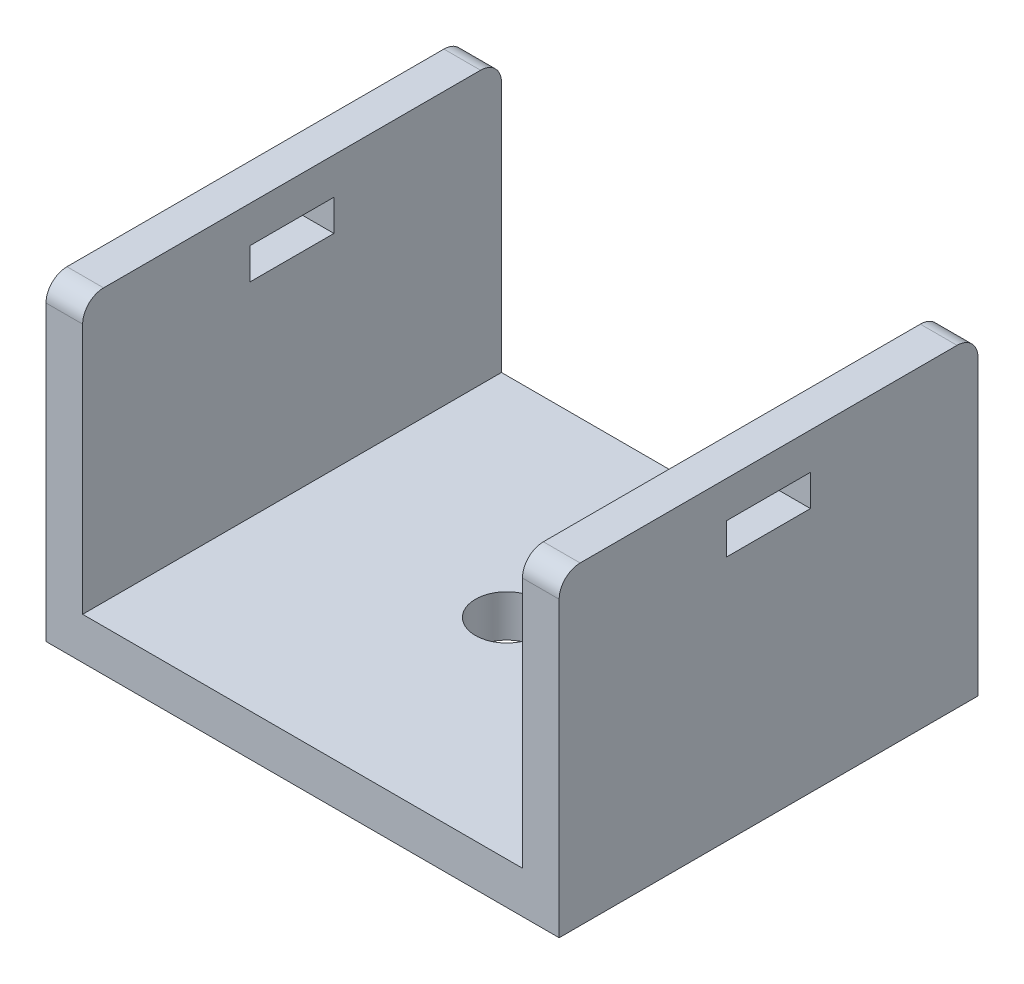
from build123d import *

# Parameters (mm, degrees)
BOSS_EXTRU_1_DEPTH      = 20
ESQUISSE2_W             = 4
ESQUISSE2_H             = 1.5
ENL_V_MAT_EXTRU_1_DEPTH = 30
ESQUISSE3_R             = 1.5
ENL_V_MAT_EXTRU_2_DEPTH = 10
CONG_1_R                = 1


with BuildPart() as part:
    # Esquisse1 → Boss.-Extru.1 (new body)
    with BuildSketch(Plane.XY):
        Polygon((0, 0), (0, 15), (1.75, 15), (1.75, 2), (22.75, 2), (22.75, 15), (24.50382671, 15), (24.50382671, 0), align=None)
    extrude(amount=BOSS_EXTRU_1_DEPTH)

    # Esquisse2 → Enl_v. mat.-Extru.1 (cut)
    with BuildSketch(Plane(origin=(24.50382671, 0, 0), x_dir=(0, 0, -1), z_dir=(1, 0, 0))):
        with Locations((-10, 12.5)):
            Rectangle(ESQUISSE2_W, ESQUISSE2_H)
    extrude(amount=-ENL_V_MAT_EXTRU_1_DEPTH, mode=Mode.SUBTRACT)

    # Esquisse3 → Enl_v. mat.-Extru.2 (cut)
    with BuildSketch(Plane.XZ):
        with Locations(Location((12.00382671, 10, 0), (0, 0, 270))):
            Circle(ESQUISSE3_R)
    extrude(amount=-ENL_V_MAT_EXTRU_2_DEPTH, mode=Mode.SUBTRACT)

    # Cong_1
    cong_1_edges = [part.edges().sort_by_distance(p)[0] for p in [
        (23.626913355, 15, 20),
        (0.875, 15, 20),
        (0.875, 15, 0),
        (23.626913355, 15, 0),
    ]]
    fillet(cong_1_edges, radius=CONG_1_R)


solid = part.part
